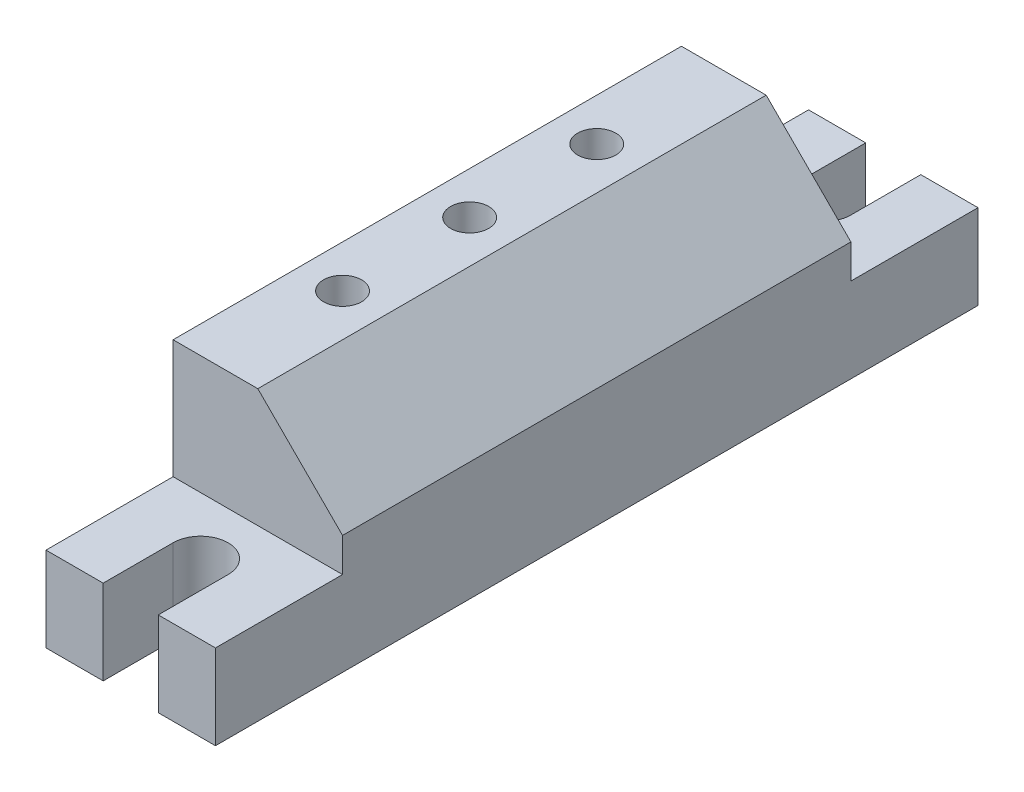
ISO-10303-21;
HEADER;
FILE_DESCRIPTION(('STEP AP214'),'2;1');
FILE_NAME('part.step','',(''),(''),'','','');
FILE_SCHEMA(('AUTOMOTIVE_DESIGN { 1 0 10303 214 1 1 1 1 }'));
ENDSEC;
DATA;
#1=APPLICATION_CONTEXT('core data for automotive mechanical design processes');
#2=APPLICATION_PROTOCOL_DEFINITION('international standard','automotive_design',2000,#1);
#3=PRODUCT_CONTEXT('',#1,'mechanical');
#4=PRODUCT('Part','Part','',(#3));
#5=PRODUCT_RELATED_PRODUCT_CATEGORY('part','',(#4));
#6=PRODUCT_DEFINITION_FORMATION('','',#4);
#7=PRODUCT_DEFINITION_CONTEXT('part definition',#1,'design');
#8=PRODUCT_DEFINITION('design','',#6,#7);
#9=PRODUCT_DEFINITION_SHAPE('','',#8);
#10=(LENGTH_UNIT() NAMED_UNIT(*) SI_UNIT(.MILLI.,.METRE.));
#11=(NAMED_UNIT(*) PLANE_ANGLE_UNIT() SI_UNIT($,.RADIAN.));
#12=(NAMED_UNIT(*) SI_UNIT($,.STERADIAN.) SOLID_ANGLE_UNIT());
#13=UNCERTAINTY_MEASURE_WITH_UNIT(LENGTH_MEASURE(1.E-05),#10,'distance_accuracy_value','');
#14=(GEOMETRIC_REPRESENTATION_CONTEXT(3) GLOBAL_UNCERTAINTY_ASSIGNED_CONTEXT((#13)) GLOBAL_UNIT_ASSIGNED_CONTEXT((#10,
#11,#12)) REPRESENTATION_CONTEXT('',''));
#15=CARTESIAN_POINT('',(0.,0.,0.));
#16=DIRECTION('',(0.,0.,1.));
#17=DIRECTION('',(1.,0.,0.));
#18=AXIS2_PLACEMENT_3D('',#15,#16,#17);
#19=CARTESIAN_POINT('',(-23.5623596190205,-16.5802838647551,20.));
#20=DIRECTION('',(0.,-1.,0.));
#21=DIRECTION('',(0.,0.,-1.));
#22=AXIS2_PLACEMENT_3D('',#19,#20,#21);
#23=CONICAL_SURFACE('',#22,2.45850000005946,1.02974425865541);
#24=CARTESIAN_POINT('',(-23.5623596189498,-15.1030680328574,20.));
#25=VERTEX_POINT('',#24);
#26=VERTEX_LOOP('',#25);
#27=FACE_BOUND('',#26,.T.);
#28=CARTESIAN_POINT('',(-23.5623596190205,-16.5802838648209,20.));
#29=DIRECTION('',(0.,-1.,0.));
#30=DIRECTION('',(0.,0.,-1.));
#31=AXIS2_PLACEMENT_3D('',#28,#29,#30);
#32=CIRCLE('',#31,2.4585);
#33=CARTESIAN_POINT('',(-23.5623596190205,-16.5802838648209,17.5415));
#34=VERTEX_POINT('',#33);
#35=EDGE_CURVE('E339',#34,#34,#32,.T.);
#36=ORIENTED_EDGE('',*,*,#35,.T.);
#37=EDGE_LOOP('',(#36));
#38=FACE_BOUND('',#37,.T.);
#39=ADVANCED_FACE('F16',(#27,#38),#23,.F.);
#40=CARTESIAN_POINT('',(-23.5623596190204,-16.5802838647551,70.));
#41=DIRECTION('',(0.,-1.,0.));
#42=DIRECTION('',(0.,0.,-1.));
#43=AXIS2_PLACEMENT_3D('',#40,#41,#42);
#44=CONICAL_SURFACE('',#43,2.45850000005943,1.0297442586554);
#45=CARTESIAN_POINT('',(-23.5623596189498,-15.1030680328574,70.));
#46=VERTEX_POINT('',#45);
#47=VERTEX_LOOP('',#46);
#48=FACE_BOUND('',#47,.T.);
#49=CARTESIAN_POINT('',(-23.5623596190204,-16.5802838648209,70.));
#50=DIRECTION('',(0.,-1.,0.));
#51=DIRECTION('',(0.,0.,-1.));
#52=AXIS2_PLACEMENT_3D('',#49,#50,#51);
#53=CIRCLE('',#52,2.4585);
#54=CARTESIAN_POINT('',(-23.5623596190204,-16.5802838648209,67.5415));
#55=VERTEX_POINT('',#54);
#56=EDGE_CURVE('E302',#55,#55,#53,.T.);
#57=ORIENTED_EDGE('',*,*,#56,.T.);
#58=EDGE_LOOP('',(#57));
#59=FACE_BOUND('',#58,.T.);
#60=ADVANCED_FACE('F543',(#48,#59),#44,.F.);
#61=CARTESIAN_POINT('',(-28.5623596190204,-19.5802838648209,45.));
#62=DIRECTION('',(0.,1.,0.));
#63=DIRECTION('',(0.,0.,1.));
#64=AXIS2_PLACEMENT_3D('',#61,#62,#63);
#65=PLANE('',#64);
#66=CARTESIAN_POINT('',(-28.5623596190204,-19.5802838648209,45.));
#67=DIRECTION('',(0.,-1.,0.));
#68=DIRECTION('',(0.,0.,-1.));
#69=AXIS2_PLACEMENT_3D('',#66,#67,#68);
#70=CIRCLE('',#69,2.25);
#71=CARTESIAN_POINT('',(-28.5623596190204,-19.5802838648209,42.75));
#72=VERTEX_POINT('',#71);
#73=EDGE_CURVE('E229',#72,#72,#70,.F.);
#74=ORIENTED_EDGE('',*,*,#73,.T.);
#75=EDGE_LOOP('',(#74));
#76=FACE_BOUND('',#75,.T.);
#77=CARTESIAN_POINT('',(-28.5623596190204,-19.5802838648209,45.));
#78=DIRECTION('',(0.,-1.,0.));
#79=DIRECTION('',(0.,0.,-1.));
#80=AXIS2_PLACEMENT_3D('',#77,#78,#79);
#81=CIRCLE('',#80,4.);
#82=CARTESIAN_POINT('',(-28.5623596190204,-19.5802838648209,41.));
#83=VERTEX_POINT('',#82);
#84=EDGE_CURVE('E20',#83,#83,#81,.T.);
#85=ORIENTED_EDGE('',*,*,#84,.T.);
#86=EDGE_LOOP('',(#85));
#87=FACE_BOUND('',#86,.T.);
#88=ADVANCED_FACE('F382',(#76,#87),#65,.F.);
#89=CARTESIAN_POINT('',(-28.5623596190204,-19.5802838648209,30.));
#90=DIRECTION('',(0.,1.,0.));
#91=DIRECTION('',(0.,0.,1.));
#92=AXIS2_PLACEMENT_3D('',#89,#90,#91);
#93=PLANE('',#92);
#94=CARTESIAN_POINT('',(-28.5623596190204,-19.5802838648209,30.));
#95=DIRECTION('',(0.,-1.,0.));
#96=DIRECTION('',(0.,0.,-1.));
#97=AXIS2_PLACEMENT_3D('',#94,#95,#96);
#98=CIRCLE('',#97,2.25);
#99=CARTESIAN_POINT('',(-28.5623596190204,-19.5802838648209,27.75));
#100=VERTEX_POINT('',#99);
#101=EDGE_CURVE('E369',#100,#100,#98,.F.);
#102=ORIENTED_EDGE('',*,*,#101,.T.);
#103=EDGE_LOOP('',(#102));
#104=FACE_BOUND('',#103,.T.);
#105=CARTESIAN_POINT('',(-28.5623596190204,-19.5802838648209,30.));
#106=DIRECTION('',(0.,-1.,0.));
#107=DIRECTION('',(0.,0.,-1.));
#108=AXIS2_PLACEMENT_3D('',#105,#106,#107);
#109=CIRCLE('',#108,4.);
#110=CARTESIAN_POINT('',(-28.5623596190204,-19.5802838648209,26.));
#111=VERTEX_POINT('',#110);
#112=EDGE_CURVE('E375',#111,#111,#109,.T.);
#113=ORIENTED_EDGE('',*,*,#112,.T.);
#114=EDGE_LOOP('',(#113));
#115=FACE_BOUND('',#114,.T.);
#116=ADVANCED_FACE('F397',(#104,#115),#93,.F.);
#117=CARTESIAN_POINT('',(-28.5623596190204,-19.5802838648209,60.));
#118=DIRECTION('',(0.,1.,0.));
#119=DIRECTION('',(0.,0.,1.));
#120=AXIS2_PLACEMENT_3D('',#117,#118,#119);
#121=PLANE('',#120);
#122=CARTESIAN_POINT('',(-28.5623596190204,-19.5802838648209,60.));
#123=DIRECTION('',(0.,-1.,0.));
#124=DIRECTION('',(0.,0.,-1.));
#125=AXIS2_PLACEMENT_3D('',#122,#123,#124);
#126=CIRCLE('',#125,2.25);
#127=CARTESIAN_POINT('',(-28.5623596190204,-19.5802838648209,57.75));
#128=VERTEX_POINT('',#127);
#129=EDGE_CURVE('E252',#128,#128,#126,.F.);
#130=ORIENTED_EDGE('',*,*,#129,.T.);
#131=EDGE_LOOP('',(#130));
#132=FACE_BOUND('',#131,.T.);
#133=CARTESIAN_POINT('',(-28.5623596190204,-19.5802838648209,60.));
#134=DIRECTION('',(0.,-1.,0.));
#135=DIRECTION('',(0.,0.,-1.));
#136=AXIS2_PLACEMENT_3D('',#133,#134,#135);
#137=CIRCLE('',#136,4.);
#138=CARTESIAN_POINT('',(-28.5623596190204,-19.5802838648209,56.));
#139=VERTEX_POINT('',#138);
#140=EDGE_CURVE('E342',#139,#139,#137,.T.);
#141=ORIENTED_EDGE('',*,*,#140,.T.);
#142=EDGE_LOOP('',(#141));
#143=FACE_BOUND('',#142,.T.);
#144=ADVANCED_FACE('F387',(#132,#143),#121,.F.);
#145=CARTESIAN_POINT('',(-28.5623596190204,-25.5802838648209,45.));
#146=DIRECTION('',(0.,-1.,0.));
#147=DIRECTION('',(0.,0.,-1.));
#148=AXIS2_PLACEMENT_3D('',#145,#146,#147);
#149=CYLINDRICAL_SURFACE('',#148,4.);
#150=CARTESIAN_POINT('',(-28.5623596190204,-31.5802838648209,45.));
#151=DIRECTION('',(0.,-1.,0.));
#152=DIRECTION('',(0.,0.,-1.));
#153=AXIS2_PLACEMENT_3D('',#150,#151,#152);
#154=CIRCLE('',#153,4.);
#155=CARTESIAN_POINT('',(-28.5623596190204,-31.5802838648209,41.));
#156=VERTEX_POINT('',#155);
#157=EDGE_CURVE('E310',#156,#156,#154,.F.);
#158=ORIENTED_EDGE('',*,*,#157,.F.);
#159=EDGE_LOOP('',(#158));
#160=FACE_BOUND('',#159,.T.);
#161=ORIENTED_EDGE('',*,*,#84,.F.);
#162=EDGE_LOOP('',(#161));
#163=FACE_BOUND('',#162,.T.);
#164=ADVANCED_FACE('F384',(#160,#163),#149,.F.);
#165=CARTESIAN_POINT('',(-28.5623596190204,-25.5802838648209,30.));
#166=DIRECTION('',(0.,-1.,0.));
#167=DIRECTION('',(0.,0.,-1.));
#168=AXIS2_PLACEMENT_3D('',#165,#166,#167);
#169=CYLINDRICAL_SURFACE('',#168,4.);
#170=CARTESIAN_POINT('',(-28.5623596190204,-31.5802838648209,30.));
#171=DIRECTION('',(0.,-1.,0.));
#172=DIRECTION('',(0.,0.,-1.));
#173=AXIS2_PLACEMENT_3D('',#170,#171,#172);
#174=CIRCLE('',#173,4.);
#175=CARTESIAN_POINT('',(-28.5623596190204,-31.5802838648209,26.));
#176=VERTEX_POINT('',#175);
#177=EDGE_CURVE('E362',#176,#176,#174,.F.);
#178=ORIENTED_EDGE('',*,*,#177,.F.);
#179=EDGE_LOOP('',(#178));
#180=FACE_BOUND('',#179,.T.);
#181=ORIENTED_EDGE('',*,*,#112,.F.);
#182=EDGE_LOOP('',(#181));
#183=FACE_BOUND('',#182,.T.);
#184=ADVANCED_FACE('F386',(#180,#183),#169,.F.);
#185=CARTESIAN_POINT('',(-28.5623596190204,-25.5802838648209,60.));
#186=DIRECTION('',(0.,-1.,0.));
#187=DIRECTION('',(0.,0.,-1.));
#188=AXIS2_PLACEMENT_3D('',#185,#186,#187);
#189=CYLINDRICAL_SURFACE('',#188,4.);
#190=CARTESIAN_POINT('',(-28.5623596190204,-31.5802838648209,60.));
#191=DIRECTION('',(0.,-1.,0.));
#192=DIRECTION('',(0.,0.,-1.));
#193=AXIS2_PLACEMENT_3D('',#190,#191,#192);
#194=CIRCLE('',#193,4.);
#195=CARTESIAN_POINT('',(-28.5623596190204,-31.5802838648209,56.));
#196=VERTEX_POINT('',#195);
#197=EDGE_CURVE('E359',#196,#196,#194,.F.);
#198=ORIENTED_EDGE('',*,*,#197,.F.);
#199=EDGE_LOOP('',(#198));
#200=FACE_BOUND('',#199,.T.);
#201=ORIENTED_EDGE('',*,*,#140,.F.);
#202=EDGE_LOOP('',(#201));
#203=FACE_BOUND('',#202,.T.);
#204=ADVANCED_FACE('F393',(#200,#203),#189,.F.);
#205=CARTESIAN_POINT('',(-23.5623596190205,-24.0802838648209,20.));
#206=DIRECTION('',(0.,-1.,0.));
#207=DIRECTION('',(0.,0.,-1.));
#208=AXIS2_PLACEMENT_3D('',#205,#206,#207);
#209=CYLINDRICAL_SURFACE('',#208,2.4585);
#210=CARTESIAN_POINT('',(-23.5623596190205,-31.5802838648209,20.));
#211=DIRECTION('',(0.,-1.,0.));
#212=DIRECTION('',(0.,0.,-1.));
#213=AXIS2_PLACEMENT_3D('',#210,#211,#212);
#214=CIRCLE('',#213,2.4585);
#215=CARTESIAN_POINT('',(-23.5623596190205,-31.5802838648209,17.5415));
#216=VERTEX_POINT('',#215);
#217=EDGE_CURVE('E356',#216,#216,#214,.F.);
#218=ORIENTED_EDGE('',*,*,#217,.F.);
#219=EDGE_LOOP('',(#218));
#220=FACE_BOUND('',#219,.T.);
#221=ORIENTED_EDGE('',*,*,#35,.F.);
#222=EDGE_LOOP('',(#221));
#223=FACE_BOUND('',#222,.T.);
#224=ADVANCED_FACE('F526',(#220,#223),#209,.F.);
#225=CARTESIAN_POINT('',(-23.5623596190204,-24.0802838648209,70.));
#226=DIRECTION('',(0.,-1.,0.));
#227=DIRECTION('',(0.,0.,-1.));
#228=AXIS2_PLACEMENT_3D('',#225,#226,#227);
#229=CYLINDRICAL_SURFACE('',#228,2.4585);
#230=CARTESIAN_POINT('',(-23.5623596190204,-31.5802838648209,70.));
#231=DIRECTION('',(0.,-1.,0.));
#232=DIRECTION('',(0.,0.,-1.));
#233=AXIS2_PLACEMENT_3D('',#230,#231,#232);
#234=CIRCLE('',#233,2.4585);
#235=CARTESIAN_POINT('',(-23.5623596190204,-31.5802838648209,67.5415));
#236=VERTEX_POINT('',#235);
#237=EDGE_CURVE('E186',#236,#236,#234,.F.);
#238=ORIENTED_EDGE('',*,*,#237,.F.);
#239=EDGE_LOOP('',(#238));
#240=FACE_BOUND('',#239,.T.);
#241=ORIENTED_EDGE('',*,*,#56,.F.);
#242=EDGE_LOOP('',(#241));
#243=FACE_BOUND('',#242,.T.);
#244=ADVANCED_FACE('F522',(#240,#243),#229,.F.);
#245=CARTESIAN_POINT('',(-26.8123596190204,-31.5802838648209,8.25));
#246=DIRECTION('',(-1.,0.,0.));
#247=DIRECTION('',(0.,0.,1.));
#248=AXIS2_PLACEMENT_3D('',#245,#246,#247);
#249=PLANE('',#248);
#250=DIRECTION('',(0.,1.,0.));
#251=VECTOR('',#250,1.);
#252=CARTESIAN_POINT('',(-26.8123596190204,-31.5802838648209,8.25));
#253=LINE('',#252,#251);
#254=CARTESIAN_POINT('',(-26.8123596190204,-21.5802838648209,8.25));
#255=VERTEX_POINT('',#254);
#256=CARTESIAN_POINT('',(-26.8123596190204,-31.5802838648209,8.25));
#257=VERTEX_POINT('',#256);
#258=EDGE_CURVE('E131',#255,#257,#253,.F.);
#259=ORIENTED_EDGE('',*,*,#258,.T.);
#260=DIRECTION('',(0.,0.,-1.));
#261=VECTOR('',#260,1.);
#262=CARTESIAN_POINT('',(-26.8123596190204,-31.5802838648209,0.));
#263=LINE('',#262,#261);
#264=CARTESIAN_POINT('',(-26.8123596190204,-31.5802838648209,0.));
#265=VERTEX_POINT('',#264);
#266=EDGE_CURVE('E177',#265,#257,#263,.F.);
#267=ORIENTED_EDGE('',*,*,#266,.F.);
#268=DIRECTION('',(0.,1.,0.));
#269=VECTOR('',#268,1.);
#270=CARTESIAN_POINT('',(-26.8123596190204,-20.688181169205,0.));
#271=LINE('',#270,#269);
#272=CARTESIAN_POINT('',(-26.8123596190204,-21.5802838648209,0.));
#273=VERTEX_POINT('',#272);
#274=EDGE_CURVE('E307',#265,#273,#271,.T.);
#275=ORIENTED_EDGE('',*,*,#274,.T.);
#276=DIRECTION('',(0.,0.,1.));
#277=VECTOR('',#276,1.);
#278=CARTESIAN_POINT('',(-26.8123596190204,-21.5802838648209,15.));
#279=LINE('',#278,#277);
#280=EDGE_CURVE('E324',#273,#255,#279,.T.);
#281=ORIENTED_EDGE('',*,*,#280,.T.);
#282=EDGE_LOOP('',(#259,#267,#275,#281));
#283=FACE_BOUND('',#282,.T.);
#284=ADVANCED_FACE('F433',(#283),#249,.F.);
#285=CARTESIAN_POINT('',(-23.5623596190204,-31.5802838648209,8.25));
#286=DIRECTION('',(0.,1.,0.));
#287=DIRECTION('',(0.,0.,1.));
#288=AXIS2_PLACEMENT_3D('',#285,#286,#287);
#289=CYLINDRICAL_SURFACE('',#288,3.25);
#290=DIRECTION('',(0.,1.,0.));
#291=VECTOR('',#290,1.);
#292=CARTESIAN_POINT('',(-20.3123596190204,-31.5802838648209,8.25));
#293=LINE('',#292,#291);
#294=CARTESIAN_POINT('',(-20.3123596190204,-21.5802838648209,8.25));
#295=VERTEX_POINT('',#294);
#296=CARTESIAN_POINT('',(-20.3123596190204,-31.5802838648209,8.25));
#297=VERTEX_POINT('',#296);
#298=EDGE_CURVE('E137',#295,#297,#293,.F.);
#299=ORIENTED_EDGE('',*,*,#298,.T.);
#300=CARTESIAN_POINT('',(-23.5623596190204,-31.5802838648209,8.25));
#301=DIRECTION('',(0.,1.,0.));
#302=DIRECTION('',(0.,0.,1.));
#303=AXIS2_PLACEMENT_3D('',#300,#301,#302);
#304=CIRCLE('',#303,3.25);
#305=EDGE_CURVE('E174',#257,#297,#304,.T.);
#306=ORIENTED_EDGE('',*,*,#305,.F.);
#307=ORIENTED_EDGE('',*,*,#258,.F.);
#308=CARTESIAN_POINT('',(-23.5623596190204,-21.5802838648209,8.25));
#309=DIRECTION('',(0.,1.,0.));
#310=DIRECTION('',(0.,0.,1.));
#311=AXIS2_PLACEMENT_3D('',#308,#309,#310);
#312=CIRCLE('',#311,3.25);
#313=EDGE_CURVE('E134',#255,#295,#312,.T.);
#314=ORIENTED_EDGE('',*,*,#313,.T.);
#315=EDGE_LOOP('',(#299,#306,#307,#314));
#316=FACE_BOUND('',#315,.T.);
#317=ADVANCED_FACE('F136',(#316),#289,.F.);
#318=CARTESIAN_POINT('',(-20.3123596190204,-31.5802838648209,0.));
#319=DIRECTION('',(1.,0.,0.));
#320=DIRECTION('',(0.,0.,-1.));
#321=AXIS2_PLACEMENT_3D('',#318,#319,#320);
#322=PLANE('',#321);
#323=DIRECTION('',(0.,1.,0.));
#324=VECTOR('',#323,1.);
#325=CARTESIAN_POINT('',(-20.3123596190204,-20.688181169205,0.));
#326=LINE('',#325,#324);
#327=CARTESIAN_POINT('',(-20.3123596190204,-21.5802838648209,0.));
#328=VERTEX_POINT('',#327);
#329=CARTESIAN_POINT('',(-20.3123596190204,-31.5802838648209,0.));
#330=VERTEX_POINT('',#329);
#331=EDGE_CURVE('E150',#328,#330,#326,.F.);
#332=ORIENTED_EDGE('',*,*,#331,.T.);
#333=DIRECTION('',(0.,0.,-1.));
#334=VECTOR('',#333,1.);
#335=CARTESIAN_POINT('',(-20.3123596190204,-31.5802838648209,0.));
#336=LINE('',#335,#334);
#337=EDGE_CURVE('E148',#297,#330,#336,.T.);
#338=ORIENTED_EDGE('',*,*,#337,.F.);
#339=ORIENTED_EDGE('',*,*,#298,.F.);
#340=DIRECTION('',(0.,0.,1.));
#341=VECTOR('',#340,1.);
#342=CARTESIAN_POINT('',(-20.3123596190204,-21.5802838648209,15.));
#343=LINE('',#342,#341);
#344=EDGE_CURVE('E141',#295,#328,#343,.F.);
#345=ORIENTED_EDGE('',*,*,#344,.T.);
#346=EDGE_LOOP('',(#332,#338,#339,#345));
#347=FACE_BOUND('',#346,.T.);
#348=ADVANCED_FACE('F145',(#347),#322,.F.);
#349=CARTESIAN_POINT('',(-24.5276294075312,-20.688181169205,0.));
#350=DIRECTION('',(0.,0.,1.));
#351=DIRECTION('',(1.,0.,0.));
#352=AXIS2_PLACEMENT_3D('',#349,#350,#351);
#353=PLANE('',#352);
#354=DIRECTION('',(1.,0.,0.));
#355=VECTOR('',#354,1.);
#356=CARTESIAN_POINT('',(-13.5623596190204,-21.5802838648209,0.));
#357=LINE('',#356,#355);
#358=CARTESIAN_POINT('',(-13.5623596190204,-21.5802838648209,0.));
#359=VERTEX_POINT('',#358);
#360=EDGE_CURVE('E155',#328,#359,#357,.T.);
#361=ORIENTED_EDGE('',*,*,#360,.T.);
#362=DIRECTION('',(0.,1.,0.));
#363=VECTOR('',#362,1.);
#364=CARTESIAN_POINT('',(-13.5623596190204,-17.5802838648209,0.));
#365=LINE('',#364,#363);
#366=CARTESIAN_POINT('',(-13.5623596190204,-31.5802838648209,0.));
#367=VERTEX_POINT('',#366);
#368=EDGE_CURVE('E251',#367,#359,#365,.T.);
#369=ORIENTED_EDGE('',*,*,#368,.F.);
#370=DIRECTION('',(1.,0.,0.));
#371=VECTOR('',#370,1.);
#372=CARTESIAN_POINT('',(-13.5623596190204,-31.5802838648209,0.));
#373=LINE('',#372,#371);
#374=EDGE_CURVE('E173',#330,#367,#373,.T.);
#375=ORIENTED_EDGE('',*,*,#374,.F.);
#376=ORIENTED_EDGE('',*,*,#331,.F.);
#377=EDGE_LOOP('',(#361,#369,#375,#376));
#378=FACE_BOUND('',#377,.T.);
#379=ADVANCED_FACE('F462',(#378),#353,.F.);
#380=CARTESIAN_POINT('',(-24.5276294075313,-20.688181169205,90.));
#381=DIRECTION('',(0.,0.,1.));
#382=DIRECTION('',(1.,0.,0.));
#383=AXIS2_PLACEMENT_3D('',#380,#381,#382);
#384=PLANE('',#383);
#385=DIRECTION('',(0.,1.,0.));
#386=VECTOR('',#385,1.);
#387=CARTESIAN_POINT('',(-13.5623596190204,-17.5802838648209,90.));
#388=LINE('',#387,#386);
#389=CARTESIAN_POINT('',(-13.5623596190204,-21.5802838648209,90.));
#390=VERTEX_POINT('',#389);
#391=CARTESIAN_POINT('',(-13.5623596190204,-31.5802838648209,90.));
#392=VERTEX_POINT('',#391);
#393=EDGE_CURVE('E249',#390,#392,#388,.F.);
#394=ORIENTED_EDGE('',*,*,#393,.F.);
#395=DIRECTION('',(1.,0.,0.));
#396=VECTOR('',#395,1.);
#397=CARTESIAN_POINT('',(-13.5623596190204,-21.5802838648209,90.));
#398=LINE('',#397,#396);
#399=CARTESIAN_POINT('',(-20.3123596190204,-21.5802838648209,90.));
#400=VERTEX_POINT('',#399);
#401=EDGE_CURVE('E198',#390,#400,#398,.F.);
#402=ORIENTED_EDGE('',*,*,#401,.T.);
#403=DIRECTION('',(0.,1.,0.));
#404=VECTOR('',#403,1.);
#405=CARTESIAN_POINT('',(-20.3123596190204,-31.5802838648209,90.));
#406=LINE('',#405,#404);
#407=CARTESIAN_POINT('',(-20.3123596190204,-31.5802838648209,90.));
#408=VERTEX_POINT('',#407);
#409=EDGE_CURVE('E238',#400,#408,#406,.F.);
#410=ORIENTED_EDGE('',*,*,#409,.T.);
#411=DIRECTION('',(1.,0.,0.));
#412=VECTOR('',#411,1.);
#413=CARTESIAN_POINT('',(-13.5623596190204,-31.5802838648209,90.));
#414=LINE('',#413,#412);
#415=EDGE_CURVE('E169',#392,#408,#414,.F.);
#416=ORIENTED_EDGE('',*,*,#415,.F.);
#417=EDGE_LOOP('',(#394,#402,#410,#416));
#418=FACE_BOUND('',#417,.T.);
#419=ADVANCED_FACE('F457',(#418),#384,.T.);
#420=CARTESIAN_POINT('',(-20.3123596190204,-31.5802838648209,81.75));
#421=DIRECTION('',(1.,0.,0.));
#422=DIRECTION('',(0.,0.,-1.));
#423=AXIS2_PLACEMENT_3D('',#420,#421,#422);
#424=PLANE('',#423);
#425=DIRECTION('',(0.,1.,0.));
#426=VECTOR('',#425,1.);
#427=CARTESIAN_POINT('',(-20.3123596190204,-31.5802838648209,81.75));
#428=LINE('',#427,#426);
#429=CARTESIAN_POINT('',(-20.3123596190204,-21.5802838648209,81.75));
#430=VERTEX_POINT('',#429);
#431=CARTESIAN_POINT('',(-20.3123596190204,-31.5802838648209,81.75));
#432=VERTEX_POINT('',#431);
#433=EDGE_CURVE('E230',#430,#432,#428,.F.);
#434=ORIENTED_EDGE('',*,*,#433,.T.);
#435=DIRECTION('',(0.,0.,-1.));
#436=VECTOR('',#435,1.);
#437=CARTESIAN_POINT('',(-20.3123596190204,-31.5802838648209,0.));
#438=LINE('',#437,#436);
#439=EDGE_CURVE('E165',#408,#432,#438,.T.);
#440=ORIENTED_EDGE('',*,*,#439,.F.);
#441=ORIENTED_EDGE('',*,*,#409,.F.);
#442=DIRECTION('',(0.,0.,1.));
#443=VECTOR('',#442,1.);
#444=CARTESIAN_POINT('',(-20.3123596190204,-21.5802838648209,95.9648969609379));
#445=LINE('',#444,#443);
#446=EDGE_CURVE('E196',#400,#430,#445,.F.);
#447=ORIENTED_EDGE('',*,*,#446,.T.);
#448=EDGE_LOOP('',(#434,#440,#441,#447));
#449=FACE_BOUND('',#448,.T.);
#450=ADVANCED_FACE('F467',(#449),#424,.F.);
#451=CARTESIAN_POINT('',(-23.5623596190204,-31.5802838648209,81.75));
#452=DIRECTION('',(0.,1.,0.));
#453=DIRECTION('',(0.,0.,1.));
#454=AXIS2_PLACEMENT_3D('',#451,#452,#453);
#455=CYLINDRICAL_SURFACE('',#454,3.24999999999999);
#456=DIRECTION('',(0.,1.,0.));
#457=VECTOR('',#456,1.);
#458=CARTESIAN_POINT('',(-26.8123596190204,-31.5802838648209,81.75));
#459=LINE('',#458,#457);
#460=CARTESIAN_POINT('',(-26.8123596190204,-21.5802838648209,81.75));
#461=VERTEX_POINT('',#460);
#462=CARTESIAN_POINT('',(-26.8123596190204,-31.5802838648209,81.75));
#463=VERTEX_POINT('',#462);
#464=EDGE_CURVE('E227',#461,#463,#459,.F.);
#465=ORIENTED_EDGE('',*,*,#464,.T.);
#466=CARTESIAN_POINT('',(-23.5623596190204,-31.5802838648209,81.75));
#467=DIRECTION('',(0.,1.,0.));
#468=DIRECTION('',(0.,0.,1.));
#469=AXIS2_PLACEMENT_3D('',#466,#467,#468);
#470=CIRCLE('',#469,3.24999999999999);
#471=EDGE_CURVE('E168',#432,#463,#470,.T.);
#472=ORIENTED_EDGE('',*,*,#471,.F.);
#473=ORIENTED_EDGE('',*,*,#433,.F.);
#474=CARTESIAN_POINT('',(-23.5623596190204,-21.5802838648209,81.75));
#475=DIRECTION('',(0.,1.,0.));
#476=DIRECTION('',(0.,0.,1.));
#477=AXIS2_PLACEMENT_3D('',#474,#475,#476);
#478=CIRCLE('',#477,3.24999999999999);
#479=EDGE_CURVE('E193',#430,#461,#478,.T.);
#480=ORIENTED_EDGE('',*,*,#479,.T.);
#481=EDGE_LOOP('',(#465,#472,#473,#480));
#482=FACE_BOUND('',#481,.T.);
#483=ADVANCED_FACE('F475',(#482),#455,.F.);
#484=CARTESIAN_POINT('',(-26.8123596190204,-31.5802838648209,90.));
#485=DIRECTION('',(-1.,0.,0.));
#486=DIRECTION('',(0.,0.,1.));
#487=AXIS2_PLACEMENT_3D('',#484,#485,#486);
#488=PLANE('',#487);
#489=DIRECTION('',(0.,1.,0.));
#490=VECTOR('',#489,1.);
#491=CARTESIAN_POINT('',(-26.8123596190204,-20.688181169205,90.));
#492=LINE('',#491,#490);
#493=CARTESIAN_POINT('',(-26.8123596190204,-31.5802838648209,90.));
#494=VERTEX_POINT('',#493);
#495=CARTESIAN_POINT('',(-26.8123596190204,-21.5802838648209,90.));
#496=VERTEX_POINT('',#495);
#497=EDGE_CURVE('E263',#494,#496,#492,.T.);
#498=ORIENTED_EDGE('',*,*,#497,.F.);
#499=DIRECTION('',(0.,0.,-1.));
#500=VECTOR('',#499,1.);
#501=CARTESIAN_POINT('',(-26.8123596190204,-31.5802838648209,0.));
#502=LINE('',#501,#500);
#503=EDGE_CURVE('E183',#463,#494,#502,.F.);
#504=ORIENTED_EDGE('',*,*,#503,.F.);
#505=ORIENTED_EDGE('',*,*,#464,.F.);
#506=DIRECTION('',(0.,0.,1.));
#507=VECTOR('',#506,1.);
#508=CARTESIAN_POINT('',(-26.8123596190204,-21.5802838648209,95.9648969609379));
#509=LINE('',#508,#507);
#510=EDGE_CURVE('E189',#461,#496,#509,.T.);
#511=ORIENTED_EDGE('',*,*,#510,.T.);
#512=EDGE_LOOP('',(#498,#504,#505,#511));
#513=FACE_BOUND('',#512,.T.);
#514=ADVANCED_FACE('F479',(#513),#488,.F.);
#515=CARTESIAN_POINT('',(-28.5623596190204,63.6877590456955,45.));
#516=DIRECTION('',(0.,-1.,0.));
#517=DIRECTION('',(0.,0.,-1.));
#518=AXIS2_PLACEMENT_3D('',#515,#516,#517);
#519=CYLINDRICAL_SURFACE('',#518,2.25);
#520=ORIENTED_EDGE('',*,*,#73,.F.);
#521=EDGE_LOOP('',(#520));
#522=FACE_BOUND('',#521,.T.);
#523=CARTESIAN_POINT('',(-28.5623596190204,-7.5802838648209,45.));
#524=DIRECTION('',(0.,-1.,0.));
#525=DIRECTION('',(0.,0.,-1.));
#526=AXIS2_PLACEMENT_3D('',#523,#524,#525);
#527=CIRCLE('',#526,2.25);
#528=CARTESIAN_POINT('',(-28.5623596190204,-7.5802838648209,42.75));
#529=VERTEX_POINT('',#528);
#530=EDGE_CURVE('E260',#529,#529,#527,.T.);
#531=ORIENTED_EDGE('',*,*,#530,.F.);
#532=EDGE_LOOP('',(#531));
#533=FACE_BOUND('',#532,.T.);
#534=ADVANCED_FACE('F483',(#522,#533),#519,.F.);
#535=CARTESIAN_POINT('',(-28.5623596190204,63.6877590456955,30.));
#536=DIRECTION('',(0.,-1.,0.));
#537=DIRECTION('',(0.,0.,-1.));
#538=AXIS2_PLACEMENT_3D('',#535,#536,#537);
#539=CYLINDRICAL_SURFACE('',#538,2.25);
#540=ORIENTED_EDGE('',*,*,#101,.F.);
#541=EDGE_LOOP('',(#540));
#542=FACE_BOUND('',#541,.T.);
#543=CARTESIAN_POINT('',(-28.5623596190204,-7.5802838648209,30.));
#544=DIRECTION('',(0.,-1.,0.));
#545=DIRECTION('',(0.,0.,-1.));
#546=AXIS2_PLACEMENT_3D('',#543,#544,#545);
#547=CIRCLE('',#546,2.25);
#548=CARTESIAN_POINT('',(-28.5623596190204,-7.5802838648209,27.75));
#549=VERTEX_POINT('',#548);
#550=EDGE_CURVE('E345',#549,#549,#547,.T.);
#551=ORIENTED_EDGE('',*,*,#550,.F.);
#552=EDGE_LOOP('',(#551));
#553=FACE_BOUND('',#552,.T.);
#554=ADVANCED_FACE('F487',(#542,#553),#539,.F.);
#555=CARTESIAN_POINT('',(-28.5623596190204,63.6877590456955,60.));
#556=DIRECTION('',(0.,-1.,0.));
#557=DIRECTION('',(0.,0.,-1.));
#558=AXIS2_PLACEMENT_3D('',#555,#556,#557);
#559=CYLINDRICAL_SURFACE('',#558,2.25);
#560=ORIENTED_EDGE('',*,*,#129,.F.);
#561=EDGE_LOOP('',(#560));
#562=FACE_BOUND('',#561,.T.);
#563=CARTESIAN_POINT('',(-28.5623596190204,-7.5802838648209,60.));
#564=DIRECTION('',(0.,-1.,0.));
#565=DIRECTION('',(0.,0.,-1.));
#566=AXIS2_PLACEMENT_3D('',#563,#564,#565);
#567=CIRCLE('',#566,2.25);
#568=CARTESIAN_POINT('',(-28.5623596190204,-7.5802838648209,57.75));
#569=VERTEX_POINT('',#568);
#570=EDGE_CURVE('E209',#569,#569,#567,.T.);
#571=ORIENTED_EDGE('',*,*,#570,.F.);
#572=EDGE_LOOP('',(#571));
#573=FACE_BOUND('',#572,.T.);
#574=ADVANCED_FACE('F491',(#562,#573),#559,.F.);
#575=CARTESIAN_POINT('',(-13.5623596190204,-17.5802838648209,0.));
#576=DIRECTION('',(1.,0.,0.));
#577=DIRECTION('',(0.,0.,-1.));
#578=AXIS2_PLACEMENT_3D('',#575,#576,#577);
#579=PLANE('',#578);
#580=DIRECTION('',(0.,0.,-1.));
#581=VECTOR('',#580,1.);
#582=CARTESIAN_POINT('',(-13.5623596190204,-31.5802838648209,0.));
#583=LINE('',#582,#581);
#584=EDGE_CURVE('E283',#367,#392,#583,.F.);
#585=ORIENTED_EDGE('',*,*,#584,.F.);
#586=ORIENTED_EDGE('',*,*,#368,.T.);
#587=DIRECTION('',(0.,0.,1.));
#588=VECTOR('',#587,1.);
#589=CARTESIAN_POINT('',(-13.5623596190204,-21.5802838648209,15.));
#590=LINE('',#589,#588);
#591=CARTESIAN_POINT('',(-13.5623596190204,-21.5802838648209,15.));
#592=VERTEX_POINT('',#591);
#593=EDGE_CURVE('E157',#359,#592,#590,.T.);
#594=ORIENTED_EDGE('',*,*,#593,.T.);
#595=DIRECTION('',(0.,-1.,0.));
#596=VECTOR('',#595,1.);
#597=CARTESIAN_POINT('',(-13.5623596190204,0.43785795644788,15.));
#598=LINE('',#597,#596);
#599=CARTESIAN_POINT('',(-13.5623596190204,-17.5802838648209,15.));
#600=VERTEX_POINT('',#599);
#601=EDGE_CURVE('E214',#592,#600,#598,.F.);
#602=ORIENTED_EDGE('',*,*,#601,.T.);
#603=DIRECTION('',(0.,0.,1.));
#604=VECTOR('',#603,1.);
#605=CARTESIAN_POINT('',(-13.5623596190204,-17.5802838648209,0.));
#606=LINE('',#605,#604);
#607=CARTESIAN_POINT('',(-13.5623596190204,-17.5802838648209,75.));
#608=VERTEX_POINT('',#607);
#609=EDGE_CURVE('E142',#608,#600,#606,.F.);
#610=ORIENTED_EDGE('',*,*,#609,.F.);
#611=DIRECTION('',(0.,1.,0.));
#612=VECTOR('',#611,1.);
#613=CARTESIAN_POINT('',(-13.5623596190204,-21.5802838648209,75.));
#614=LINE('',#613,#612);
#615=CARTESIAN_POINT('',(-13.5623596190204,-21.5802838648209,75.));
#616=VERTEX_POINT('',#615);
#617=EDGE_CURVE('E203',#608,#616,#614,.F.);
#618=ORIENTED_EDGE('',*,*,#617,.T.);
#619=DIRECTION('',(0.,0.,1.));
#620=VECTOR('',#619,1.);
#621=CARTESIAN_POINT('',(-13.5623596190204,-21.5802838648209,95.9648969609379));
#622=LINE('',#621,#620);
#623=EDGE_CURVE('E233',#616,#390,#622,.T.);
#624=ORIENTED_EDGE('',*,*,#623,.T.);
#625=ORIENTED_EDGE('',*,*,#393,.T.);
#626=EDGE_LOOP('',(#585,#586,#594,#602,#610,#618,#624,#625));
#627=FACE_BOUND('',#626,.T.);
#628=ADVANCED_FACE('F429',(#627),#579,.T.);
#629=CARTESIAN_POINT('',(-23.5623596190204,-7.5802838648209,0.));
#630=DIRECTION('',(0.707106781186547,0.707106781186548,0.));
#631=DIRECTION('',(-0.707106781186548,0.707106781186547,0.));
#632=AXIS2_PLACEMENT_3D('',#629,#630,#631);
#633=PLANE('',#632);
#634=DIRECTION('',(0.707106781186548,-0.707106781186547,0.));
#635=VECTOR('',#634,1.);
#636=CARTESIAN_POINT('',(-23.5623596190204,-7.5802838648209,75.));
#637=LINE('',#636,#635);
#638=CARTESIAN_POINT('',(-23.5623596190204,-7.5802838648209,75.));
#639=VERTEX_POINT('',#638);
#640=EDGE_CURVE('E192',#639,#608,#637,.T.);
#641=ORIENTED_EDGE('',*,*,#640,.T.);
#642=ORIENTED_EDGE('',*,*,#609,.T.);
#643=DIRECTION('',(-0.707106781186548,0.707106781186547,0.));
#644=VECTOR('',#643,1.);
#645=CARTESIAN_POINT('',(-13.5623596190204,-17.5802838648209,15.));
#646=LINE('',#645,#644);
#647=CARTESIAN_POINT('',(-23.5623596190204,-7.5802838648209,15.));
#648=VERTEX_POINT('',#647);
#649=EDGE_CURVE('E210',#600,#648,#646,.T.);
#650=ORIENTED_EDGE('',*,*,#649,.T.);
#651=DIRECTION('',(0.,0.,1.));
#652=VECTOR('',#651,1.);
#653=CARTESIAN_POINT('',(-23.5623596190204,-7.5802838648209,0.));
#654=LINE('',#653,#652);
#655=EDGE_CURVE('E204',#639,#648,#654,.F.);
#656=ORIENTED_EDGE('',*,*,#655,.F.);
#657=EDGE_LOOP('',(#641,#642,#650,#656));
#658=FACE_BOUND('',#657,.T.);
#659=ADVANCED_FACE('F419',(#658),#633,.T.);
#660=CARTESIAN_POINT('',(-13.5623596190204,-21.5802838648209,15.));
#661=DIRECTION('',(0.,-1.,0.));
#662=DIRECTION('',(1.,0.,0.));
#663=AXIS2_PLACEMENT_3D('',#660,#661,#662);
#664=PLANE('',#663);
#665=DIRECTION('',(1.,0.,0.));
#666=VECTOR('',#665,1.);
#667=CARTESIAN_POINT('',(-24.5276294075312,-21.5802838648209,0.));
#668=LINE('',#667,#666);
#669=CARTESIAN_POINT('',(-33.5623596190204,-21.5802838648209,0.));
#670=VERTEX_POINT('',#669);
#671=EDGE_CURVE('E311',#273,#670,#668,.F.);
#672=ORIENTED_EDGE('',*,*,#671,.T.);
#673=DIRECTION('',(0.,0.,1.));
#674=VECTOR('',#673,1.);
#675=CARTESIAN_POINT('',(-33.5623596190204,-21.5802838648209,0.));
#676=LINE('',#675,#674);
#677=CARTESIAN_POINT('',(-33.5623596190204,-21.5802838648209,15.));
#678=VERTEX_POINT('',#677);
#679=EDGE_CURVE('E213',#678,#670,#676,.F.);
#680=ORIENTED_EDGE('',*,*,#679,.F.);
#681=DIRECTION('',(1.,0.,0.));
#682=VECTOR('',#681,1.);
#683=CARTESIAN_POINT('',(-13.5623596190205,-21.5802838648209,15.));
#684=LINE('',#683,#682);
#685=EDGE_CURVE('E217',#678,#592,#684,.T.);
#686=ORIENTED_EDGE('',*,*,#685,.T.);
#687=ORIENTED_EDGE('',*,*,#593,.F.);
#688=ORIENTED_EDGE('',*,*,#360,.F.);
#689=ORIENTED_EDGE('',*,*,#344,.F.);
#690=ORIENTED_EDGE('',*,*,#313,.F.);
#691=ORIENTED_EDGE('',*,*,#280,.F.);
#692=EDGE_LOOP('',(#672,#680,#686,#687,#688,#689,#690,#691));
#693=FACE_BOUND('',#692,.T.);
#694=ADVANCED_FACE('F153',(#693),#664,.F.);
#695=CARTESIAN_POINT('',(-24.5276294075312,-20.688181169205,0.));
#696=DIRECTION('',(0.,0.,1.));
#697=DIRECTION('',(1.,0.,0.));
#698=AXIS2_PLACEMENT_3D('',#695,#696,#697);
#699=PLANE('',#698);
#700=DIRECTION('',(1.,0.,0.));
#701=VECTOR('',#700,1.);
#702=CARTESIAN_POINT('',(-13.5623596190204,-31.5802838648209,0.));
#703=LINE('',#702,#701);
#704=CARTESIAN_POINT('',(-33.5623596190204,-31.5802838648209,0.));
#705=VERTEX_POINT('',#704);
#706=EDGE_CURVE('E180',#705,#265,#703,.T.);
#707=ORIENTED_EDGE('',*,*,#706,.F.);
#708=DIRECTION('',(0.,-1.,0.));
#709=VECTOR('',#708,1.);
#710=CARTESIAN_POINT('',(-33.5623596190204,-31.5802838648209,0.));
#711=LINE('',#710,#709);
#712=EDGE_CURVE('E316',#670,#705,#711,.T.);
#713=ORIENTED_EDGE('',*,*,#712,.F.);
#714=ORIENTED_EDGE('',*,*,#671,.F.);
#715=ORIENTED_EDGE('',*,*,#274,.F.);
#716=EDGE_LOOP('',(#707,#713,#714,#715));
#717=FACE_BOUND('',#716,.T.);
#718=ADVANCED_FACE('F438',(#717),#699,.F.);
#719=CARTESIAN_POINT('',(-13.5623596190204,-31.5802838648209,0.));
#720=DIRECTION('',(0.,-1.,0.));
#721=DIRECTION('',(0.,0.,-1.));
#722=AXIS2_PLACEMENT_3D('',#719,#720,#721);
#723=PLANE('',#722);
#724=ORIENTED_EDGE('',*,*,#439,.T.);
#725=ORIENTED_EDGE('',*,*,#471,.T.);
#726=ORIENTED_EDGE('',*,*,#503,.T.);
#727=DIRECTION('',(1.,0.,0.));
#728=VECTOR('',#727,1.);
#729=CARTESIAN_POINT('',(-24.5276294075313,-31.5802838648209,90.));
#730=LINE('',#729,#728);
#731=CARTESIAN_POINT('',(-33.5623596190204,-31.5802838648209,90.));
#732=VERTEX_POINT('',#731);
#733=EDGE_CURVE('E234',#732,#494,#730,.T.);
#734=ORIENTED_EDGE('',*,*,#733,.F.);
#735=DIRECTION('',(0.,0.,1.));
#736=VECTOR('',#735,1.);
#737=CARTESIAN_POINT('',(-33.5623596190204,-31.5802838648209,0.));
#738=LINE('',#737,#736);
#739=EDGE_CURVE('E274',#705,#732,#738,.T.);
#740=ORIENTED_EDGE('',*,*,#739,.F.);
#741=ORIENTED_EDGE('',*,*,#706,.T.);
#742=ORIENTED_EDGE('',*,*,#266,.T.);
#743=ORIENTED_EDGE('',*,*,#305,.T.);
#744=ORIENTED_EDGE('',*,*,#337,.T.);
#745=ORIENTED_EDGE('',*,*,#374,.T.);
#746=ORIENTED_EDGE('',*,*,#584,.T.);
#747=ORIENTED_EDGE('',*,*,#415,.T.);
#748=EDGE_LOOP('',(#724,#725,#726,#734,#740,#741,#742,#743,#744,#745,#746,#747));
#749=FACE_BOUND('',#748,.T.);
#750=ORIENTED_EDGE('',*,*,#237,.T.);
#751=EDGE_LOOP('',(#750));
#752=FACE_BOUND('',#751,.T.);
#753=ORIENTED_EDGE('',*,*,#217,.T.);
#754=EDGE_LOOP('',(#753));
#755=FACE_BOUND('',#754,.T.);
#756=ORIENTED_EDGE('',*,*,#197,.T.);
#757=EDGE_LOOP('',(#756));
#758=FACE_BOUND('',#757,.T.);
#759=ORIENTED_EDGE('',*,*,#177,.T.);
#760=EDGE_LOOP('',(#759));
#761=FACE_BOUND('',#760,.T.);
#762=ORIENTED_EDGE('',*,*,#157,.T.);
#763=EDGE_LOOP('',(#762));
#764=FACE_BOUND('',#763,.T.);
#765=ADVANCED_FACE('F442',(#749,#752,#755,#758,#761,#764),#723,.T.);
#766=CARTESIAN_POINT('',(-24.5276294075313,-20.688181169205,90.));
#767=DIRECTION('',(0.,0.,1.));
#768=DIRECTION('',(1.,0.,0.));
#769=AXIS2_PLACEMENT_3D('',#766,#767,#768);
#770=PLANE('',#769);
#771=DIRECTION('',(0.,-1.,0.));
#772=VECTOR('',#771,1.);
#773=CARTESIAN_POINT('',(-33.5623596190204,-31.5802838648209,90.));
#774=LINE('',#773,#772);
#775=CARTESIAN_POINT('',(-33.5623596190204,-21.5802838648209,90.));
#776=VERTEX_POINT('',#775);
#777=EDGE_CURVE('E269',#732,#776,#774,.F.);
#778=ORIENTED_EDGE('',*,*,#777,.F.);
#779=ORIENTED_EDGE('',*,*,#733,.T.);
#780=ORIENTED_EDGE('',*,*,#497,.T.);
#781=DIRECTION('',(1.,0.,0.));
#782=VECTOR('',#781,1.);
#783=CARTESIAN_POINT('',(-13.5623596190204,-21.5802838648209,90.));
#784=LINE('',#783,#782);
#785=EDGE_CURVE('E231',#496,#776,#784,.F.);
#786=ORIENTED_EDGE('',*,*,#785,.T.);
#787=EDGE_LOOP('',(#778,#779,#780,#786));
#788=FACE_BOUND('',#787,.T.);
#789=ADVANCED_FACE('F446',(#788),#770,.T.);
#790=CARTESIAN_POINT('',(-13.5623596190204,-21.5802838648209,95.9648969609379));
#791=DIRECTION('',(0.,-1.,0.));
#792=DIRECTION('',(1.,0.,0.));
#793=AXIS2_PLACEMENT_3D('',#790,#791,#792);
#794=PLANE('',#793);
#795=ORIENTED_EDGE('',*,*,#479,.F.);
#796=ORIENTED_EDGE('',*,*,#446,.F.);
#797=ORIENTED_EDGE('',*,*,#401,.F.);
#798=ORIENTED_EDGE('',*,*,#623,.F.);
#799=DIRECTION('',(-1.,0.,0.));
#800=VECTOR('',#799,1.);
#801=CARTESIAN_POINT('',(-13.5623596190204,-21.5802838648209,75.));
#802=LINE('',#801,#800);
#803=CARTESIAN_POINT('',(-33.5623596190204,-21.5802838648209,75.));
#804=VERTEX_POINT('',#803);
#805=EDGE_CURVE('E256',#616,#804,#802,.T.);
#806=ORIENTED_EDGE('',*,*,#805,.T.);
#807=DIRECTION('',(0.,0.,1.));
#808=VECTOR('',#807,1.);
#809=CARTESIAN_POINT('',(-33.5623596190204,-21.5802838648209,0.));
#810=LINE('',#809,#808);
#811=EDGE_CURVE('E226',#776,#804,#810,.F.);
#812=ORIENTED_EDGE('',*,*,#811,.F.);
#813=ORIENTED_EDGE('',*,*,#785,.F.);
#814=ORIENTED_EDGE('',*,*,#510,.F.);
#815=EDGE_LOOP('',(#795,#796,#797,#798,#806,#812,#813,#814));
#816=FACE_BOUND('',#815,.T.);
#817=ADVANCED_FACE('F452',(#816),#794,.F.);
#818=CARTESIAN_POINT('',(-13.5623596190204,-21.5802838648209,75.));
#819=DIRECTION('',(0.,0.,-1.));
#820=DIRECTION('',(-1.,0.,0.));
#821=AXIS2_PLACEMENT_3D('',#818,#819,#820);
#822=PLANE('',#821);
#823=ORIENTED_EDGE('',*,*,#805,.F.);
#824=ORIENTED_EDGE('',*,*,#617,.F.);
#825=ORIENTED_EDGE('',*,*,#640,.F.);
#826=DIRECTION('',(1.,0.,0.));
#827=VECTOR('',#826,1.);
#828=CARTESIAN_POINT('',(-33.5623596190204,-7.5802838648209,75.));
#829=LINE('',#828,#827);
#830=CARTESIAN_POINT('',(-33.5623596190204,-7.5802838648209,75.));
#831=VERTEX_POINT('',#830);
#832=EDGE_CURVE('E206',#831,#639,#829,.T.);
#833=ORIENTED_EDGE('',*,*,#832,.F.);
#834=DIRECTION('',(0.,-1.,0.));
#835=VECTOR('',#834,1.);
#836=CARTESIAN_POINT('',(-33.5623596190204,-31.5802838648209,75.));
#837=LINE('',#836,#835);
#838=EDGE_CURVE('E223',#804,#831,#837,.F.);
#839=ORIENTED_EDGE('',*,*,#838,.F.);
#840=EDGE_LOOP('',(#823,#824,#825,#833,#839));
#841=FACE_BOUND('',#840,.T.);
#842=ADVANCED_FACE('F415',(#841),#822,.F.);
#843=CARTESIAN_POINT('',(-33.5623596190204,-7.5802838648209,0.));
#844=DIRECTION('',(0.,1.,0.));
#845=DIRECTION('',(0.,0.,1.));
#846=AXIS2_PLACEMENT_3D('',#843,#844,#845);
#847=PLANE('',#846);
#848=ORIENTED_EDGE('',*,*,#832,.T.);
#849=ORIENTED_EDGE('',*,*,#655,.T.);
#850=DIRECTION('',(1.,0.,0.));
#851=VECTOR('',#850,1.);
#852=CARTESIAN_POINT('',(-13.5623596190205,-7.5802838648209,15.));
#853=LINE('',#852,#851);
#854=CARTESIAN_POINT('',(-33.5623596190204,-7.5802838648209,15.));
#855=VERTEX_POINT('',#854);
#856=EDGE_CURVE('E35',#648,#855,#853,.F.);
#857=ORIENTED_EDGE('',*,*,#856,.T.);
#858=DIRECTION('',(0.,0.,1.));
#859=VECTOR('',#858,1.);
#860=CARTESIAN_POINT('',(-33.5623596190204,-7.5802838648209,0.));
#861=LINE('',#860,#859);
#862=EDGE_CURVE('E26',#831,#855,#861,.F.);
#863=ORIENTED_EDGE('',*,*,#862,.F.);
#864=EDGE_LOOP('',(#848,#849,#857,#863));
#865=FACE_BOUND('',#864,.T.);
#866=ORIENTED_EDGE('',*,*,#570,.T.);
#867=EDGE_LOOP('',(#866));
#868=FACE_BOUND('',#867,.T.);
#869=ORIENTED_EDGE('',*,*,#550,.T.);
#870=EDGE_LOOP('',(#869));
#871=FACE_BOUND('',#870,.T.);
#872=ORIENTED_EDGE('',*,*,#530,.T.);
#873=EDGE_LOOP('',(#872));
#874=FACE_BOUND('',#873,.T.);
#875=ADVANCED_FACE('F406',(#865,#868,#871,#874),#847,.T.);
#876=CARTESIAN_POINT('',(-13.5623596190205,0.43785795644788,15.));
#877=DIRECTION('',(0.,0.,1.));
#878=DIRECTION('',(0.,-1.,0.));
#879=AXIS2_PLACEMENT_3D('',#876,#877,#878);
#880=PLANE('',#879);
#881=ORIENTED_EDGE('',*,*,#601,.F.);
#882=ORIENTED_EDGE('',*,*,#685,.F.);
#883=DIRECTION('',(0.,-1.,0.));
#884=VECTOR('',#883,1.);
#885=CARTESIAN_POINT('',(-33.5623596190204,-31.5802838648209,15.));
#886=LINE('',#885,#884);
#887=EDGE_CURVE('E10',#855,#678,#886,.T.);
#888=ORIENTED_EDGE('',*,*,#887,.F.);
#889=ORIENTED_EDGE('',*,*,#856,.F.);
#890=ORIENTED_EDGE('',*,*,#649,.F.);
#891=EDGE_LOOP('',(#881,#882,#888,#889,#890));
#892=FACE_BOUND('',#891,.T.);
#893=ADVANCED_FACE('F402',(#892),#880,.F.);
#894=CARTESIAN_POINT('',(-33.5623596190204,-31.5802838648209,0.));
#895=DIRECTION('',(-1.,0.,0.));
#896=DIRECTION('',(0.,-1.,0.));
#897=AXIS2_PLACEMENT_3D('',#894,#895,#896);
#898=PLANE('',#897);
#899=ORIENTED_EDGE('',*,*,#862,.T.);
#900=ORIENTED_EDGE('',*,*,#887,.T.);
#901=ORIENTED_EDGE('',*,*,#679,.T.);
#902=ORIENTED_EDGE('',*,*,#712,.T.);
#903=ORIENTED_EDGE('',*,*,#739,.T.);
#904=ORIENTED_EDGE('',*,*,#777,.T.);
#905=ORIENTED_EDGE('',*,*,#811,.T.);
#906=ORIENTED_EDGE('',*,*,#838,.T.);
#907=EDGE_LOOP('',(#899,#900,#901,#902,#903,#904,#905,#906));
#908=FACE_BOUND('',#907,.T.);
#909=ADVANCED_FACE('F18',(#908),#898,.T.);
#910=CLOSED_SHELL('',(#39,#60,#88,#116,#144,#164,#184,#204,#224,#244,#284,#317,#348,#379,#419,
#450,#483,#514,#534,#554,#574,#628,#659,#694,#718,#765,#789,#817,#842,#875,#893,#909));
#911=MANIFOLD_SOLID_BREP('B1',#910);
#912=ADVANCED_BREP_SHAPE_REPRESENTATION('',(#18,#911),#14);
#913=SHAPE_DEFINITION_REPRESENTATION(#9,#912);
ENDSEC;
END-ISO-10303-21;
